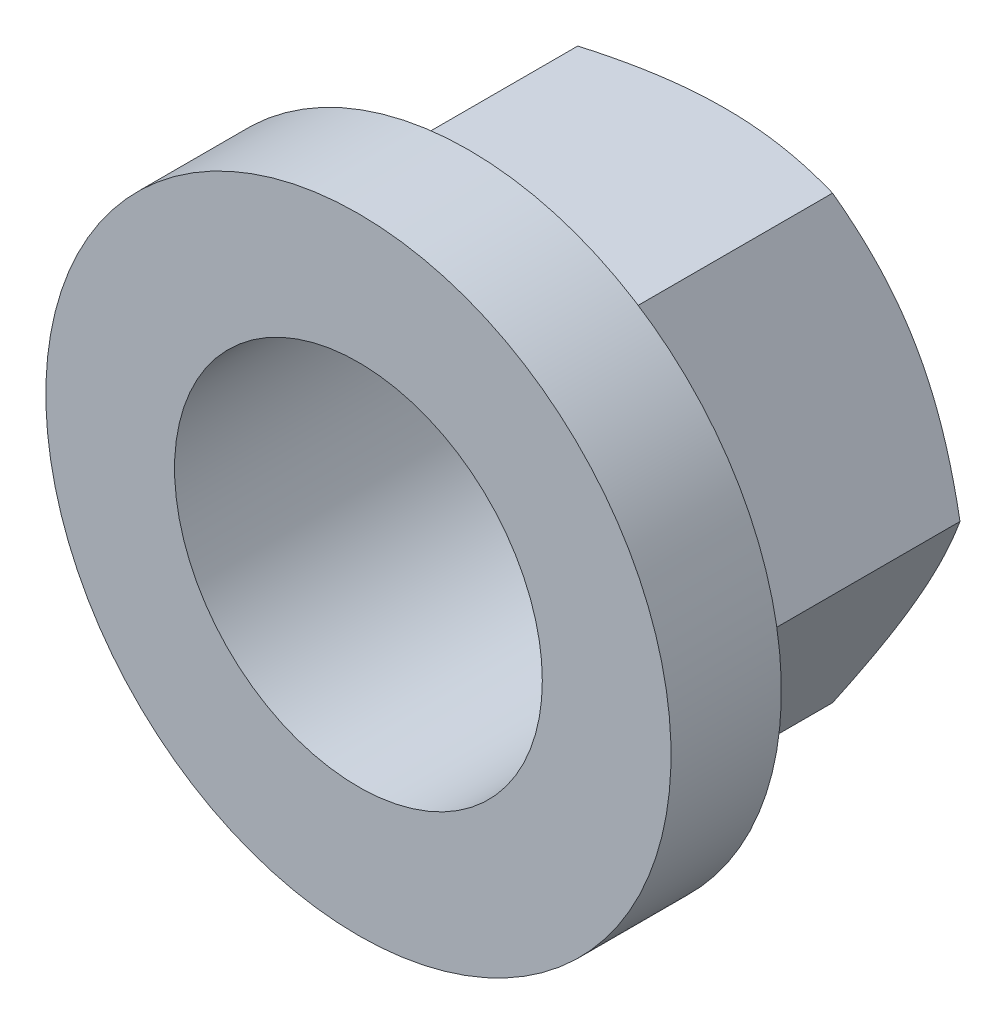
from build123d import *

# Parameters (mm, degrees)
BASE_EXTRUSION_DEPTH    = 3.75
ESQUISSE4_R             = 4
ENL_V_MAT_EXTRU_1_DEPTH = 12.842719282
ESQUISSE6_W             = 3
ESQUISSE6_H             = 8.5
ESQUISSE7_R             = 4
ENL_V_MAT_EXTRU_2_DEPTH = 14.892397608
ESQUISSE8_R             = 5
ENL_V_MAT_EXTRU_3_DEPTH = 16.613562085


with BuildPart() as part:
    # Esquisse1 → Base-Extrusion (new, symmetric)
    with BuildSketch(Plane.XY):
        Polygon((3.464101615, -6), (6.92820323, 0), (3.464101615, 6), (-3.464101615, 6), (-6.92820323, 0), (-3.464101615, -6), align=None)
    extrude(amount=BASE_EXTRUSION_DEPTH, both=True)

    # Esquisse4 → Enl_v. mat.-Extru.1 (cut, through all)
    with BuildSketch(Plane.XY.offset(3.75)):
        Circle(ESQUISSE4_R)
    extrude(amount=-ENL_V_MAT_EXTRU_1_DEPTH, mode=Mode.SUBTRACT)

    # Esquisse5 → Enl_vement de mati_re-R_volution1 (revolve, cut)
    with BuildSketch(Plane(origin=(0, 0, 0), x_dir=(0, 0, -1), z_dir=(1, 0, 0))):
        Polygon((3.75, -6), (-3.75, -18.990381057), (3.75, -18.990381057), align=None)
    enl_vement_de_mati_re_r_volution1 = revolve(axis=Axis((0, 0, 0), (0, 0, 1)), mode=Mode.SUBTRACT)

    # Sym_trie1: Enl_vement de mati_re-R_volution1 across plane
    add(enl_vement_de_mati_re_r_volution1.mirror(Plane.XY), mode=Mode.SUBTRACT)

    # Esquisse6 → R_volution1 (revolve)
    with BuildSketch(Plane(origin=(0, 0, 0), x_dir=(0, 0, -1), z_dir=(1, 0, 0))):
        with Locations((-4.714101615, 4.25)):
            Rectangle(ESQUISSE6_W, ESQUISSE6_H)
    revolve(axis=Axis((0, 0, 0), (0, 0, 1)))

    # Esquisse7 → Enl_v. mat.-Extru.2 (cut, through all)
    with BuildSketch(Plane(origin=(0, 0, 3.214101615), x_dir=(-1, 0, 0), z_dir=(0, 0, -1))):
        with Locations(Location((0, 0, 0), (0, 0, 180))):
            Circle(ESQUISSE7_R)
    extrude(amount=-ENL_V_MAT_EXTRU_2_DEPTH, mode=Mode.SUBTRACT)

    # Esquisse8 → Enl_v. mat.-Extru.3 (cut, through all)
    with BuildSketch(Plane.XY.offset(6.214101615)):
        Circle(ESQUISSE8_R)
    extrude(amount=-ENL_V_MAT_EXTRU_3_DEPTH, mode=Mode.SUBTRACT)


solid = part.part
